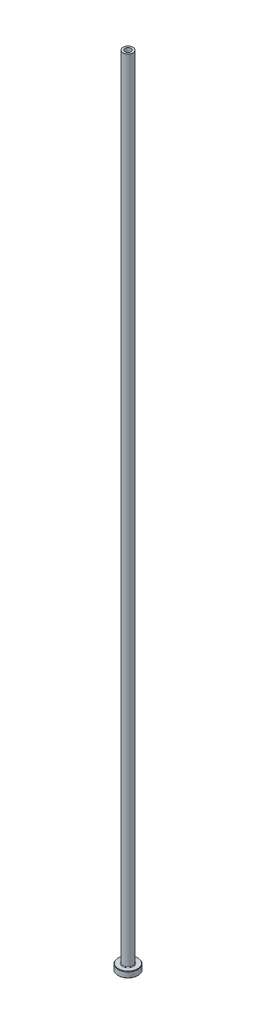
ISO-10303-21;
HEADER;
FILE_DESCRIPTION(('STEP AP214'),'2;1');
FILE_NAME('part.step','',(''),(''),'','','');
FILE_SCHEMA(('AUTOMOTIVE_DESIGN { 1 0 10303 214 1 1 1 1 }'));
ENDSEC;
DATA;
#1=APPLICATION_CONTEXT('core data for automotive mechanical design processes');
#2=APPLICATION_PROTOCOL_DEFINITION('international standard','automotive_design',2000,#1);
#3=PRODUCT_CONTEXT('',#1,'mechanical');
#4=PRODUCT('Part','Part','',(#3));
#5=PRODUCT_RELATED_PRODUCT_CATEGORY('part','',(#4));
#6=PRODUCT_DEFINITION_FORMATION('','',#4);
#7=PRODUCT_DEFINITION_CONTEXT('part definition',#1,'design');
#8=PRODUCT_DEFINITION('design','',#6,#7);
#9=PRODUCT_DEFINITION_SHAPE('','',#8);
#10=(LENGTH_UNIT() NAMED_UNIT(*) SI_UNIT(.MILLI.,.METRE.));
#11=(NAMED_UNIT(*) PLANE_ANGLE_UNIT() SI_UNIT($,.RADIAN.));
#12=(NAMED_UNIT(*) SI_UNIT($,.STERADIAN.) SOLID_ANGLE_UNIT());
#13=UNCERTAINTY_MEASURE_WITH_UNIT(LENGTH_MEASURE(1.E-05),#10,'distance_accuracy_value','');
#14=(GEOMETRIC_REPRESENTATION_CONTEXT(3) GLOBAL_UNCERTAINTY_ASSIGNED_CONTEXT((#13)) GLOBAL_UNIT_ASSIGNED_CONTEXT((#10,
#11,#12)) REPRESENTATION_CONTEXT('',''));
#15=CARTESIAN_POINT('',(0.,0.,0.));
#16=DIRECTION('',(0.,0.,1.));
#17=DIRECTION('',(1.,0.,0.));
#18=AXIS2_PLACEMENT_3D('',#15,#16,#17);
#19=CARTESIAN_POINT('',(0.,92.1876809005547,0.));
#20=DIRECTION('',(0.,1.,0.));
#21=DIRECTION('',(0.,0.,1.));
#22=AXIS2_PLACEMENT_3D('',#19,#20,#21);
#23=CYLINDRICAL_SURFACE('',#22,1.50000000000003);
#24=CARTESIAN_POINT('',(0.,400.,0.));
#25=DIRECTION('',(0.,1.,0.));
#26=DIRECTION('',(0.,0.,1.));
#27=AXIS2_PLACEMENT_3D('',#24,#25,#26);
#28=CIRCLE('',#27,1.50000000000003);
#29=CARTESIAN_POINT('',(0.,400.,1.50000000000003));
#30=VERTEX_POINT('',#29);
#31=EDGE_CURVE('E62',#30,#30,#28,.T.);
#32=ORIENTED_EDGE('',*,*,#31,.T.);
#33=EDGE_LOOP('',(#32));
#34=FACE_BOUND('',#33,.T.);
#35=CARTESIAN_POINT('',(0.,355.,0.));
#36=DIRECTION('',(0.,1.,0.));
#37=DIRECTION('',(0.,0.,1.));
#38=AXIS2_PLACEMENT_3D('',#35,#36,#37);
#39=CIRCLE('',#38,1.50000000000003);
#40=CARTESIAN_POINT('',(0.,355.,1.50000000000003));
#41=VERTEX_POINT('',#40);
#42=EDGE_CURVE('E71',#41,#41,#39,.T.);
#43=ORIENTED_EDGE('',*,*,#42,.F.);
#44=EDGE_LOOP('',(#43));
#45=FACE_BOUND('',#44,.T.);
#46=ADVANCED_FACE('F30',(#34,#45),#23,.F.);
#47=CARTESIAN_POINT('',(-1.50000000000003,400.,0.));
#48=DIRECTION('',(0.,1.,0.));
#49=DIRECTION('',(0.,0.,1.));
#50=AXIS2_PLACEMENT_3D('',#47,#48,#49);
#51=PLANE('',#50);
#52=CARTESIAN_POINT('',(0.,400.,0.));
#53=DIRECTION('',(0.,1.,0.));
#54=DIRECTION('',(0.,0.,1.));
#55=AXIS2_PLACEMENT_3D('',#52,#53,#54);
#56=CIRCLE('',#55,2.50000000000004);
#57=CARTESIAN_POINT('',(0.,400.,2.50000000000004));
#58=VERTEX_POINT('',#57);
#59=EDGE_CURVE('E65',#58,#58,#56,.T.);
#60=ORIENTED_EDGE('',*,*,#59,.T.);
#61=EDGE_LOOP('',(#60));
#62=FACE_BOUND('',#61,.T.);
#63=ORIENTED_EDGE('',*,*,#31,.F.);
#64=EDGE_LOOP('',(#63));
#65=FACE_BOUND('',#64,.T.);
#66=ADVANCED_FACE('F79',(#62,#65),#51,.T.);
#67=CARTESIAN_POINT('',(0.,92.1876809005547,0.));
#68=DIRECTION('',(0.,1.,0.));
#69=DIRECTION('',(0.,0.,1.));
#70=AXIS2_PLACEMENT_3D('',#67,#68,#69);
#71=CYLINDRICAL_SURFACE('',#70,2.50000000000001);
#72=CARTESIAN_POINT('',(0.,3.3,0.));
#73=DIRECTION('',(0.,1.,0.));
#74=DIRECTION('',(0.,0.,1.));
#75=AXIS2_PLACEMENT_3D('',#72,#73,#74);
#76=CIRCLE('',#75,2.50000000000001);
#77=CARTESIAN_POINT('',(0.,3.3,2.50000000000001));
#78=VERTEX_POINT('',#77);
#79=EDGE_CURVE('E59',#78,#78,#76,.T.);
#80=ORIENTED_EDGE('',*,*,#79,.T.);
#81=EDGE_LOOP('',(#80));
#82=FACE_BOUND('',#81,.T.);
#83=ORIENTED_EDGE('',*,*,#59,.F.);
#84=EDGE_LOOP('',(#83));
#85=FACE_BOUND('',#84,.T.);
#86=ADVANCED_FACE('F85',(#82,#85),#71,.T.);
#87=CARTESIAN_POINT('',(-2.49999999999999,3.,0.));
#88=DIRECTION('',(0.,1.,0.));
#89=DIRECTION('',(0.,0.,1.));
#90=AXIS2_PLACEMENT_3D('',#87,#88,#89);
#91=PLANE('',#90);
#92=CARTESIAN_POINT('',(0.,3.,0.));
#93=DIRECTION('',(0.,1.,0.));
#94=DIRECTION('',(0.,0.,1.));
#95=AXIS2_PLACEMENT_3D('',#92,#93,#94);
#96=CIRCLE('',#95,4.79999999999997);
#97=CARTESIAN_POINT('',(0.,3.,4.79999999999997));
#98=VERTEX_POINT('',#97);
#99=EDGE_CURVE('E53',#98,#98,#96,.T.);
#100=ORIENTED_EDGE('',*,*,#99,.T.);
#101=EDGE_LOOP('',(#100));
#102=FACE_BOUND('',#101,.T.);
#103=CARTESIAN_POINT('',(0.,3.,0.));
#104=DIRECTION('',(0.,1.,0.));
#105=DIRECTION('',(0.,0.,1.));
#106=AXIS2_PLACEMENT_3D('',#103,#104,#105);
#107=CIRCLE('',#106,2.80000000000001);
#108=CARTESIAN_POINT('',(0.,3.,2.80000000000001));
#109=VERTEX_POINT('',#108);
#110=EDGE_CURVE('E56',#109,#109,#107,.F.);
#111=ORIENTED_EDGE('',*,*,#110,.T.);
#112=EDGE_LOOP('',(#111));
#113=FACE_BOUND('',#112,.T.);
#114=ADVANCED_FACE('F111',(#102,#113),#91,.T.);
#115=CARTESIAN_POINT('',(0.,92.1876809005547,0.));
#116=DIRECTION('',(0.,1.,0.));
#117=DIRECTION('',(0.,0.,1.));
#118=AXIS2_PLACEMENT_3D('',#115,#116,#117);
#119=CYLINDRICAL_SURFACE('',#118,4.99999999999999);
#120=CARTESIAN_POINT('',(0.,2.80000000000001,0.));
#121=DIRECTION('',(0.,1.,0.));
#122=DIRECTION('',(0.,0.,1.));
#123=AXIS2_PLACEMENT_3D('',#120,#121,#122);
#124=CIRCLE('',#123,4.99999999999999);
#125=CARTESIAN_POINT('',(0.,2.80000000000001,4.99999999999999));
#126=VERTEX_POINT('',#125);
#127=EDGE_CURVE('E45',#126,#126,#124,.F.);
#128=ORIENTED_EDGE('',*,*,#127,.T.);
#129=EDGE_LOOP('',(#128));
#130=FACE_BOUND('',#129,.T.);
#131=CARTESIAN_POINT('',(0.,0.200000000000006,0.));
#132=DIRECTION('',(0.,-1.,0.));
#133=DIRECTION('',(0.,0.,-1.));
#134=AXIS2_PLACEMENT_3D('',#131,#132,#133);
#135=CIRCLE('',#134,4.99999999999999);
#136=CARTESIAN_POINT('',(0.,0.200000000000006,-4.99999999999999));
#137=VERTEX_POINT('',#136);
#138=EDGE_CURVE('E50',#137,#137,#135,.F.);
#139=ORIENTED_EDGE('',*,*,#138,.T.);
#140=EDGE_LOOP('',(#139));
#141=FACE_BOUND('',#140,.T.);
#142=ADVANCED_FACE('F108',(#130,#141),#119,.T.);
#143=CARTESIAN_POINT('',(-4.99999999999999,0.,0.));
#144=DIRECTION('',(0.,-1.,0.));
#145=DIRECTION('',(0.,0.,-1.));
#146=AXIS2_PLACEMENT_3D('',#143,#144,#145);
#147=PLANE('',#146);
#148=CARTESIAN_POINT('',(0.,0.,0.));
#149=DIRECTION('',(0.,-1.,0.));
#150=DIRECTION('',(0.,0.,-1.));
#151=AXIS2_PLACEMENT_3D('',#148,#149,#150);
#152=CIRCLE('',#151,2.24999999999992);
#153=CARTESIAN_POINT('',(0.,0.,-2.24999999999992));
#154=VERTEX_POINT('',#153);
#155=EDGE_CURVE('E37',#154,#154,#152,.F.);
#156=ORIENTED_EDGE('',*,*,#155,.T.);
#157=EDGE_LOOP('',(#156));
#158=FACE_BOUND('',#157,.T.);
#159=CARTESIAN_POINT('',(0.,0.,0.));
#160=DIRECTION('',(0.,-1.,0.));
#161=DIRECTION('',(0.,0.,-1.));
#162=AXIS2_PLACEMENT_3D('',#159,#160,#161);
#163=CIRCLE('',#162,4.79999999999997);
#164=CARTESIAN_POINT('',(0.,0.,-4.79999999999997));
#165=VERTEX_POINT('',#164);
#166=EDGE_CURVE('E41',#165,#165,#163,.T.);
#167=ORIENTED_EDGE('',*,*,#166,.T.);
#168=EDGE_LOOP('',(#167));
#169=FACE_BOUND('',#168,.T.);
#170=ADVANCED_FACE('F110',(#158,#169),#147,.T.);
#171=CARTESIAN_POINT('',(0.,92.1876809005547,0.));
#172=DIRECTION('',(0.,1.,0.));
#173=DIRECTION('',(0.,0.,1.));
#174=AXIS2_PLACEMENT_3D('',#171,#172,#173);
#175=CYLINDRICAL_SURFACE('',#174,1.75000000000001);
#176=CARTESIAN_POINT('',(0.,0.499999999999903,0.));
#177=DIRECTION('',(0.,-1.,0.));
#178=DIRECTION('',(0.,0.,-1.));
#179=AXIS2_PLACEMENT_3D('',#176,#177,#178);
#180=CIRCLE('',#179,1.75000000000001);
#181=CARTESIAN_POINT('',(0.,0.499999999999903,-1.75000000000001));
#182=VERTEX_POINT('',#181);
#183=EDGE_CURVE('E10',#182,#182,#180,.T.);
#184=ORIENTED_EDGE('',*,*,#183,.T.);
#185=EDGE_LOOP('',(#184));
#186=FACE_BOUND('',#185,.T.);
#187=CARTESIAN_POINT('',(0.,343.,0.));
#188=DIRECTION('',(0.,1.,0.));
#189=DIRECTION('',(0.,0.,1.));
#190=AXIS2_PLACEMENT_3D('',#187,#188,#189);
#191=CIRCLE('',#190,1.75000000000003);
#192=CARTESIAN_POINT('',(0.,343.,1.75000000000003));
#193=VERTEX_POINT('',#192);
#194=EDGE_CURVE('E68',#193,#193,#191,.T.);
#195=ORIENTED_EDGE('',*,*,#194,.T.);
#196=EDGE_LOOP('',(#195));
#197=FACE_BOUND('',#196,.T.);
#198=ADVANCED_FACE('F118',(#186,#197),#175,.F.);
#199=CARTESIAN_POINT('',(0.,343.,0.));
#200=DIRECTION('',(0.,-1.,0.));
#201=DIRECTION('',(0.,0.,-1.));
#202=AXIS2_PLACEMENT_3D('',#199,#200,#201);
#203=CONICAL_SURFACE('',#202,1.75000000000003,0.0208303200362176);
#204=ORIENTED_EDGE('',*,*,#42,.T.);
#205=EDGE_LOOP('',(#204));
#206=FACE_BOUND('',#205,.T.);
#207=ORIENTED_EDGE('',*,*,#194,.F.);
#208=EDGE_LOOP('',(#207));
#209=FACE_BOUND('',#208,.T.);
#210=ADVANCED_FACE('F75',(#206,#209),#203,.F.);
#211=CARTESIAN_POINT('',(0.,3.3,0.));
#212=DIRECTION('',(0.,1.,0.));
#213=DIRECTION('',(0.,0.,1.));
#214=AXIS2_PLACEMENT_3D('',#211,#212,#213);
#215=TOROIDAL_SURFACE('',#214,2.80000000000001,0.3);
#216=ORIENTED_EDGE('',*,*,#110,.F.);
#217=EDGE_LOOP('',(#216));
#218=FACE_BOUND('',#217,.T.);
#219=ORIENTED_EDGE('',*,*,#79,.F.);
#220=EDGE_LOOP('',(#219));
#221=FACE_BOUND('',#220,.T.);
#222=ADVANCED_FACE('F90',(#218,#221),#215,.F.);
#223=CARTESIAN_POINT('',(0.,3.,0.));
#224=DIRECTION('',(0.,-1.,0.));
#225=DIRECTION('',(0.,0.,-1.));
#226=AXIS2_PLACEMENT_3D('',#223,#224,#225);
#227=CONICAL_SURFACE('',#226,4.79999999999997,0.785398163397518);
#228=ORIENTED_EDGE('',*,*,#127,.F.);
#229=EDGE_LOOP('',(#228));
#230=FACE_BOUND('',#229,.T.);
#231=ORIENTED_EDGE('',*,*,#99,.F.);
#232=EDGE_LOOP('',(#231));
#233=FACE_BOUND('',#232,.T.);
#234=ADVANCED_FACE('F93',(#230,#233),#227,.T.);
#235=CARTESIAN_POINT('',(0.,0.200000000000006,0.));
#236=DIRECTION('',(0.,1.,0.));
#237=DIRECTION('',(0.,0.,1.));
#238=AXIS2_PLACEMENT_3D('',#235,#236,#237);
#239=CONICAL_SURFACE('',#238,4.99999999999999,0.785398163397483);
#240=ORIENTED_EDGE('',*,*,#166,.F.);
#241=EDGE_LOOP('',(#240));
#242=FACE_BOUND('',#241,.T.);
#243=ORIENTED_EDGE('',*,*,#138,.F.);
#244=EDGE_LOOP('',(#243));
#245=FACE_BOUND('',#244,.T.);
#246=ADVANCED_FACE('F96',(#242,#245),#239,.T.);
#247=CARTESIAN_POINT('',(0.,0.,0.));
#248=DIRECTION('',(0.,-1.,0.));
#249=DIRECTION('',(0.,0.,-1.));
#250=AXIS2_PLACEMENT_3D('',#247,#248,#249);
#251=CONICAL_SURFACE('',#250,2.24999999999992,0.785398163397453);
#252=ORIENTED_EDGE('',*,*,#183,.F.);
#253=EDGE_LOOP('',(#252));
#254=FACE_BOUND('',#253,.T.);
#255=ORIENTED_EDGE('',*,*,#155,.F.);
#256=EDGE_LOOP('',(#255));
#257=FACE_BOUND('',#256,.T.);
#258=ADVANCED_FACE('F32',(#254,#257),#251,.F.);
#259=CLOSED_SHELL('',(#46,#66,#86,#114,#142,#170,#198,#210,#222,#234,#246,#258));
#260=MANIFOLD_SOLID_BREP('B2',#259);
#261=ADVANCED_BREP_SHAPE_REPRESENTATION('',(#18,#260),#14);
#262=SHAPE_DEFINITION_REPRESENTATION(#9,#261);
ENDSEC;
END-ISO-10303-21;
